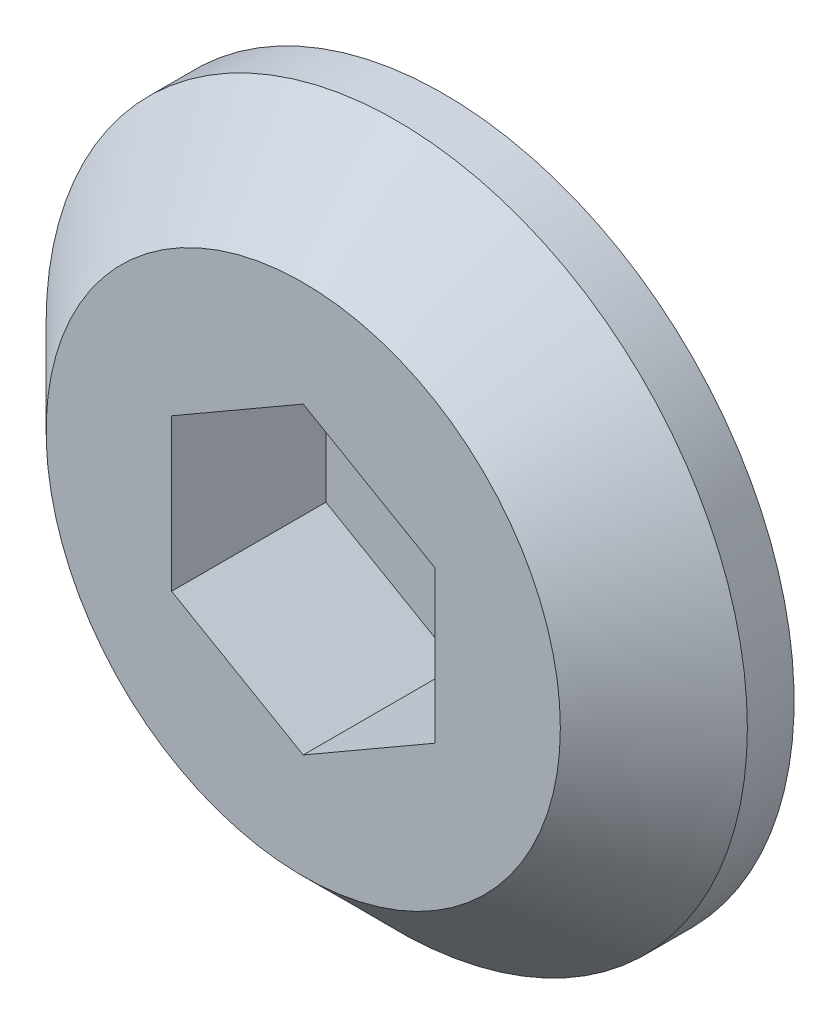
from build123d import *

# Parameters (mm, degrees)
CROQUIS1_R              = 7.5
SALIENTE_EXTRUIR1_DEPTH = 2.5
CHAFL_N1_SIZE           = 2
CORTAR_EXTRUIR1_DEPTH   = 3.3
CROQUIS3_R              = 1.55
CORTAR_EXTRUIR2_DEPTH   = 12.108105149
CORTAR_EXTRUIR3_START   = -2
CROQUIS4_R              = 7.5
CROQUIS4_R_2            = 3.875
CORTAR_EXTRUIR3_DEPTH   = 2


with BuildPart() as part:
    # Croquis1 → Saliente-Extruir1 (new, symmetric)
    with BuildSketch(Plane.XY):
        Circle(CROQUIS1_R)
    extrude(amount=SALIENTE_EXTRUIR1_DEPTH, both=True)

    # Chafl_n1
    chafl_n1_edges = [part.edges().sort_by_distance(p)[0] for p in [
        (-7.5, 0, 2.5),
    ]]
    chamfer(chafl_n1_edges, length=CHAFL_N1_SIZE)

    # Croquis2 → Cortar-Extruir1 (cut)
    with BuildSketch(Plane.XY.offset(2.5)):
        Polygon((0, -3.25), (2.814582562, -1.625), (2.814582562, 1.625), (0, 3.25), (-2.814582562, 1.625), (-2.814582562, -1.625), align=None)
    extrude(amount=-CORTAR_EXTRUIR1_DEPTH, mode=Mode.SUBTRACT)

    # Croquis3 → Cortar-Extruir2 (cut, through all)
    with BuildSketch(Plane.XY.offset(-0.8)):
        Circle(CROQUIS3_R)
    extrude(amount=-CORTAR_EXTRUIR2_DEPTH, mode=Mode.SUBTRACT)

    # Croquis4 → Cortar-Extruir3 (cut)
    with BuildSketch(Plane(origin=(0, 0, -2.5), x_dir=(-1, 0, 0), z_dir=(0, 0, -1)).offset(CORTAR_EXTRUIR3_START)):
        Circle(CROQUIS4_R)
        Circle(CROQUIS4_R_2, mode=Mode.SUBTRACT)
    extrude(amount=CORTAR_EXTRUIR3_DEPTH, mode=Mode.SUBTRACT)


solid = part.part
